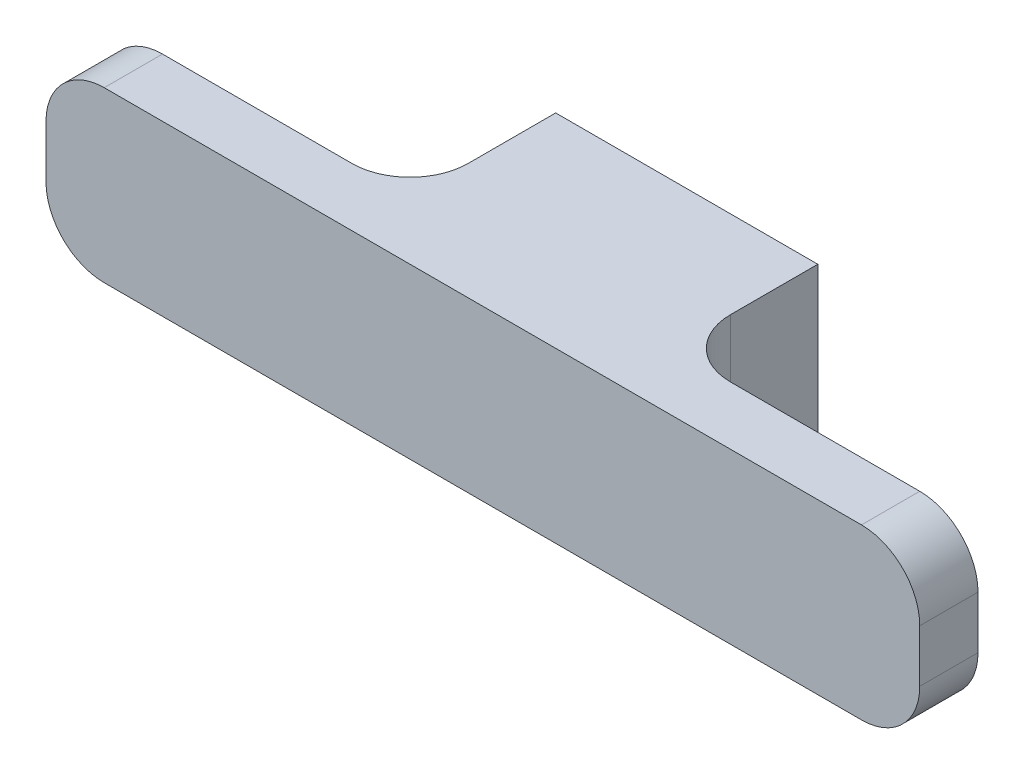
ISO-10303-21;
HEADER;
FILE_DESCRIPTION(('STEP AP214'),'2;1');
FILE_NAME('part.step','',(''),(''),'','','');
FILE_SCHEMA(('AUTOMOTIVE_DESIGN { 1 0 10303 214 1 1 1 1 }'));
ENDSEC;
DATA;
#1=APPLICATION_CONTEXT('core data for automotive mechanical design processes');
#2=APPLICATION_PROTOCOL_DEFINITION('international standard','automotive_design',2000,#1);
#3=PRODUCT_CONTEXT('',#1,'mechanical');
#4=PRODUCT('Part','Part','',(#3));
#5=PRODUCT_RELATED_PRODUCT_CATEGORY('part','',(#4));
#6=PRODUCT_DEFINITION_FORMATION('','',#4);
#7=PRODUCT_DEFINITION_CONTEXT('part definition',#1,'design');
#8=PRODUCT_DEFINITION('design','',#6,#7);
#9=PRODUCT_DEFINITION_SHAPE('','',#8);
#10=(LENGTH_UNIT() NAMED_UNIT(*) SI_UNIT(.MILLI.,.METRE.));
#11=(NAMED_UNIT(*) PLANE_ANGLE_UNIT() SI_UNIT($,.RADIAN.));
#12=(NAMED_UNIT(*) SI_UNIT($,.STERADIAN.) SOLID_ANGLE_UNIT());
#13=UNCERTAINTY_MEASURE_WITH_UNIT(LENGTH_MEASURE(1.E-05),#10,'distance_accuracy_value','');
#14=(GEOMETRIC_REPRESENTATION_CONTEXT(3) GLOBAL_UNCERTAINTY_ASSIGNED_CONTEXT((#13)) GLOBAL_UNIT_ASSIGNED_CONTEXT((#10,
#11,#12)) REPRESENTATION_CONTEXT('',''));
#15=CARTESIAN_POINT('',(0.,0.,0.));
#16=DIRECTION('',(0.,0.,1.));
#17=DIRECTION('',(1.,0.,0.));
#18=AXIS2_PLACEMENT_3D('',#15,#16,#17);
#19=CARTESIAN_POINT('',(2.25,-1.45,2.5));
#20=DIRECTION('',(-1.,0.,0.));
#21=DIRECTION('',(0.,0.,1.));
#22=AXIS2_PLACEMENT_3D('',#19,#20,#21);
#23=PLANE('',#22);
#24=DIRECTION('',(0.,0.,-1.));
#25=VECTOR('',#24,1.);
#26=CARTESIAN_POINT('',(2.25,1.45,2.5));
#27=LINE('',#26,#25);
#28=CARTESIAN_POINT('',(2.25,1.45,1.5));
#29=VERTEX_POINT('',#28);
#30=CARTESIAN_POINT('',(2.25,1.45,0.));
#31=VERTEX_POINT('',#30);
#32=EDGE_CURVE('E136',#29,#31,#27,.T.);
#33=ORIENTED_EDGE('',*,*,#32,.F.);
#34=DIRECTION('',(0.,1.,0.));
#35=VECTOR('',#34,1.);
#36=CARTESIAN_POINT('',(2.25,-1.45,1.5));
#37=LINE('',#36,#35);
#38=CARTESIAN_POINT('',(2.25,-1.45,1.5));
#39=VERTEX_POINT('',#38);
#40=EDGE_CURVE('E180',#29,#39,#37,.F.);
#41=ORIENTED_EDGE('',*,*,#40,.T.);
#42=DIRECTION('',(0.,0.,-1.));
#43=VECTOR('',#42,1.);
#44=CARTESIAN_POINT('',(2.25,-1.45,2.5));
#45=LINE('',#44,#43);
#46=CARTESIAN_POINT('',(2.25,-1.45,0.));
#47=VERTEX_POINT('',#46);
#48=EDGE_CURVE('E160',#39,#47,#45,.T.);
#49=ORIENTED_EDGE('',*,*,#48,.T.);
#50=DIRECTION('',(0.,1.,0.));
#51=VECTOR('',#50,1.);
#52=CARTESIAN_POINT('',(2.25,-1.45,0.));
#53=LINE('',#52,#51);
#54=EDGE_CURVE('E155',#47,#31,#53,.T.);
#55=ORIENTED_EDGE('',*,*,#54,.T.);
#56=EDGE_LOOP('',(#33,#41,#49,#55));
#57=FACE_BOUND('',#56,.T.);
#58=ADVANCED_FACE('F34',(#57),#23,.F.);
#59=CARTESIAN_POINT('',(-2.25,1.45,2.5));
#60=DIRECTION('',(0.,-1.,0.));
#61=DIRECTION('',(0.,0.,-1.));
#62=AXIS2_PLACEMENT_3D('',#59,#60,#61);
#63=PLANE('',#62);
#64=DIRECTION('',(-1.,0.,0.));
#65=VECTOR('',#64,1.);
#66=CARTESIAN_POINT('',(-7.5,1.45,2.5));
#67=LINE('',#66,#65);
#68=CARTESIAN_POINT('',(-3.25,1.45,2.5));
#69=VERTEX_POINT('',#68);
#70=CARTESIAN_POINT('',(-6.5,1.45,2.5));
#71=VERTEX_POINT('',#70);
#72=EDGE_CURVE('E232',#69,#71,#67,.T.);
#73=ORIENTED_EDGE('',*,*,#72,.T.);
#74=DIRECTION('',(0.,0.,-1.));
#75=VECTOR('',#74,1.);
#76=CARTESIAN_POINT('',(-6.5,1.45,2.5));
#77=LINE('',#76,#75);
#78=CARTESIAN_POINT('',(-6.5,1.45,3.5));
#79=VERTEX_POINT('',#78);
#80=EDGE_CURVE('E206',#71,#79,#77,.F.);
#81=ORIENTED_EDGE('',*,*,#80,.T.);
#82=DIRECTION('',(-1.,0.,0.));
#83=VECTOR('',#82,1.);
#84=CARTESIAN_POINT('',(-7.5,1.45,3.5));
#85=LINE('',#84,#83);
#86=CARTESIAN_POINT('',(6.5,1.45,3.5));
#87=VERTEX_POINT('',#86);
#88=EDGE_CURVE('E162',#87,#79,#85,.T.);
#89=ORIENTED_EDGE('',*,*,#88,.F.);
#90=DIRECTION('',(0.,0.,-1.));
#91=VECTOR('',#90,1.);
#92=CARTESIAN_POINT('',(6.5,1.45,2.5));
#93=LINE('',#92,#91);
#94=CARTESIAN_POINT('',(6.5,1.45,2.5));
#95=VERTEX_POINT('',#94);
#96=EDGE_CURVE('E203',#87,#95,#93,.T.);
#97=ORIENTED_EDGE('',*,*,#96,.T.);
#98=CARTESIAN_POINT('',(3.25,1.45,2.5));
#99=VERTEX_POINT('',#98);
#100=EDGE_CURVE('E168',#95,#99,#67,.T.);
#101=ORIENTED_EDGE('',*,*,#100,.T.);
#102=CARTESIAN_POINT('',(3.25,1.45,1.5));
#103=DIRECTION('',(0.,-1.,0.));
#104=DIRECTION('',(0.,0.,-1.));
#105=AXIS2_PLACEMENT_3D('',#102,#103,#104);
#106=CIRCLE('',#105,1.);
#107=EDGE_CURVE('E144',#99,#29,#106,.T.);
#108=ORIENTED_EDGE('',*,*,#107,.T.);
#109=ORIENTED_EDGE('',*,*,#32,.T.);
#110=DIRECTION('',(-1.,0.,0.));
#111=VECTOR('',#110,1.);
#112=CARTESIAN_POINT('',(-2.25,1.45,0.));
#113=LINE('',#112,#111);
#114=CARTESIAN_POINT('',(-2.25,1.45,0.));
#115=VERTEX_POINT('',#114);
#116=EDGE_CURVE('E141',#31,#115,#113,.T.);
#117=ORIENTED_EDGE('',*,*,#116,.T.);
#118=DIRECTION('',(0.,0.,-1.));
#119=VECTOR('',#118,1.);
#120=CARTESIAN_POINT('',(-2.25,1.45,2.5));
#121=LINE('',#120,#119);
#122=CARTESIAN_POINT('',(-2.25,1.45,1.5));
#123=VERTEX_POINT('',#122);
#124=EDGE_CURVE('E149',#123,#115,#121,.T.);
#125=ORIENTED_EDGE('',*,*,#124,.F.);
#126=CARTESIAN_POINT('',(-3.25,1.45,1.5));
#127=DIRECTION('',(0.,-1.,0.));
#128=DIRECTION('',(0.,0.,-1.));
#129=AXIS2_PLACEMENT_3D('',#126,#127,#128);
#130=CIRCLE('',#129,1.);
#131=EDGE_CURVE('E192',#123,#69,#130,.T.);
#132=ORIENTED_EDGE('',*,*,#131,.T.);
#133=EDGE_LOOP('',(#73,#81,#89,#97,#101,#108,#109,#117,#125,#132));
#134=FACE_BOUND('',#133,.T.);
#135=ADVANCED_FACE('F139',(#134),#63,.F.);
#136=CARTESIAN_POINT('',(-2.25,-1.45,2.5));
#137=DIRECTION('',(1.,0.,0.));
#138=DIRECTION('',(0.,0.,-1.));
#139=AXIS2_PLACEMENT_3D('',#136,#137,#138);
#140=PLANE('',#139);
#141=DIRECTION('',(0.,0.,-1.));
#142=VECTOR('',#141,1.);
#143=CARTESIAN_POINT('',(-2.25,-1.45,2.5));
#144=LINE('',#143,#142);
#145=CARTESIAN_POINT('',(-2.25,-1.45,1.5));
#146=VERTEX_POINT('',#145);
#147=CARTESIAN_POINT('',(-2.25,-1.45,0.));
#148=VERTEX_POINT('',#147);
#149=EDGE_CURVE('E175',#146,#148,#144,.T.);
#150=ORIENTED_EDGE('',*,*,#149,.F.);
#151=DIRECTION('',(0.,-1.,0.));
#152=VECTOR('',#151,1.);
#153=CARTESIAN_POINT('',(-2.25,-1.45,1.5));
#154=LINE('',#153,#152);
#155=EDGE_CURVE('E185',#146,#123,#154,.F.);
#156=ORIENTED_EDGE('',*,*,#155,.T.);
#157=ORIENTED_EDGE('',*,*,#124,.T.);
#158=DIRECTION('',(0.,-1.,0.));
#159=VECTOR('',#158,1.);
#160=CARTESIAN_POINT('',(-2.25,-1.45,0.));
#161=LINE('',#160,#159);
#162=EDGE_CURVE('E157',#115,#148,#161,.T.);
#163=ORIENTED_EDGE('',*,*,#162,.T.);
#164=EDGE_LOOP('',(#150,#156,#157,#163));
#165=FACE_BOUND('',#164,.T.);
#166=ADVANCED_FACE('F284',(#165),#140,.F.);
#167=CARTESIAN_POINT('',(-2.25,-1.45,2.5));
#168=DIRECTION('',(0.,1.,0.));
#169=DIRECTION('',(0.,0.,1.));
#170=AXIS2_PLACEMENT_3D('',#167,#168,#169);
#171=PLANE('',#170);
#172=DIRECTION('',(1.,0.,0.));
#173=VECTOR('',#172,1.);
#174=CARTESIAN_POINT('',(-7.5,-1.45,3.5));
#175=LINE('',#174,#173);
#176=CARTESIAN_POINT('',(-6.5,-1.45,3.5));
#177=VERTEX_POINT('',#176);
#178=CARTESIAN_POINT('',(6.5,-1.45,3.5));
#179=VERTEX_POINT('',#178);
#180=EDGE_CURVE('E241',#177,#179,#175,.T.);
#181=ORIENTED_EDGE('',*,*,#180,.F.);
#182=DIRECTION('',(0.,0.,-1.));
#183=VECTOR('',#182,1.);
#184=CARTESIAN_POINT('',(-6.5,-1.45,2.5));
#185=LINE('',#184,#183);
#186=CARTESIAN_POINT('',(-6.5,-1.45,2.5));
#187=VERTEX_POINT('',#186);
#188=EDGE_CURVE('E218',#177,#187,#185,.T.);
#189=ORIENTED_EDGE('',*,*,#188,.T.);
#190=DIRECTION('',(1.,0.,0.));
#191=VECTOR('',#190,1.);
#192=CARTESIAN_POINT('',(-7.5,-1.45,2.5));
#193=LINE('',#192,#191);
#194=CARTESIAN_POINT('',(-3.25,-1.45,2.5));
#195=VERTEX_POINT('',#194);
#196=EDGE_CURVE('E233',#187,#195,#193,.T.);
#197=ORIENTED_EDGE('',*,*,#196,.T.);
#198=CARTESIAN_POINT('',(-3.25,-1.45,1.5));
#199=DIRECTION('',(0.,1.,0.));
#200=DIRECTION('',(0.,0.,1.));
#201=AXIS2_PLACEMENT_3D('',#198,#199,#200);
#202=CIRCLE('',#201,1.);
#203=EDGE_CURVE('E190',#195,#146,#202,.T.);
#204=ORIENTED_EDGE('',*,*,#203,.T.);
#205=ORIENTED_EDGE('',*,*,#149,.T.);
#206=DIRECTION('',(1.,0.,0.));
#207=VECTOR('',#206,1.);
#208=CARTESIAN_POINT('',(-2.25,-1.45,0.));
#209=LINE('',#208,#207);
#210=EDGE_CURVE('E172',#148,#47,#209,.T.);
#211=ORIENTED_EDGE('',*,*,#210,.T.);
#212=ORIENTED_EDGE('',*,*,#48,.F.);
#213=CARTESIAN_POINT('',(3.25,-1.45,1.5));
#214=DIRECTION('',(0.,1.,0.));
#215=DIRECTION('',(0.,0.,1.));
#216=AXIS2_PLACEMENT_3D('',#213,#214,#215);
#217=CIRCLE('',#216,1.);
#218=CARTESIAN_POINT('',(3.25,-1.45,2.5));
#219=VERTEX_POINT('',#218);
#220=EDGE_CURVE('E188',#39,#219,#217,.T.);
#221=ORIENTED_EDGE('',*,*,#220,.T.);
#222=CARTESIAN_POINT('',(6.5,-1.45,2.5));
#223=VERTEX_POINT('',#222);
#224=EDGE_CURVE('E234',#219,#223,#193,.T.);
#225=ORIENTED_EDGE('',*,*,#224,.T.);
#226=DIRECTION('',(0.,0.,-1.));
#227=VECTOR('',#226,1.);
#228=CARTESIAN_POINT('',(6.5,-1.45,2.5));
#229=LINE('',#228,#227);
#230=EDGE_CURVE('E216',#223,#179,#229,.F.);
#231=ORIENTED_EDGE('',*,*,#230,.T.);
#232=EDGE_LOOP('',(#181,#189,#197,#204,#205,#211,#212,#221,#225,#231));
#233=FACE_BOUND('',#232,.T.);
#234=ADVANCED_FACE('F257',(#233),#171,.F.);
#235=CARTESIAN_POINT('',(0.,0.,0.));
#236=DIRECTION('',(0.,0.,-1.));
#237=DIRECTION('',(-1.,0.,0.));
#238=AXIS2_PLACEMENT_3D('',#235,#236,#237);
#239=PLANE('',#238);
#240=ORIENTED_EDGE('',*,*,#54,.F.);
#241=ORIENTED_EDGE('',*,*,#210,.F.);
#242=ORIENTED_EDGE('',*,*,#162,.F.);
#243=ORIENTED_EDGE('',*,*,#116,.F.);
#244=EDGE_LOOP('',(#240,#241,#242,#243));
#245=FACE_BOUND('',#244,.T.);
#246=ADVANCED_FACE('F153',(#245),#239,.T.);
#247=CARTESIAN_POINT('',(0.,0.,2.5));
#248=DIRECTION('',(0.,0.,-1.));
#249=DIRECTION('',(-1.,0.,0.));
#250=AXIS2_PLACEMENT_3D('',#247,#248,#249);
#251=PLANE('',#250);
#252=ORIENTED_EDGE('',*,*,#100,.F.);
#253=CARTESIAN_POINT('',(6.5,0.45,2.5));
#254=DIRECTION('',(0.,0.,-1.));
#255=DIRECTION('',(-1.,0.,0.));
#256=AXIS2_PLACEMENT_3D('',#253,#254,#255);
#257=CIRCLE('',#256,1.);
#258=CARTESIAN_POINT('',(7.5,0.45,2.5));
#259=VERTEX_POINT('',#258);
#260=EDGE_CURVE('E49',#95,#259,#257,.T.);
#261=ORIENTED_EDGE('',*,*,#260,.T.);
#262=DIRECTION('',(0.,1.,0.));
#263=VECTOR('',#262,1.);
#264=CARTESIAN_POINT('',(7.5,-1.45,2.5));
#265=LINE('',#264,#263);
#266=CARTESIAN_POINT('',(7.5,-0.449999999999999,2.5));
#267=VERTEX_POINT('',#266);
#268=EDGE_CURVE('E225',#267,#259,#265,.T.);
#269=ORIENTED_EDGE('',*,*,#268,.F.);
#270=CARTESIAN_POINT('',(6.5,-0.449999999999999,2.5));
#271=DIRECTION('',(0.,0.,-1.));
#272=DIRECTION('',(-1.,0.,0.));
#273=AXIS2_PLACEMENT_3D('',#270,#271,#272);
#274=CIRCLE('',#273,1.);
#275=EDGE_CURVE('E57',#267,#223,#274,.T.);
#276=ORIENTED_EDGE('',*,*,#275,.T.);
#277=ORIENTED_EDGE('',*,*,#224,.F.);
#278=DIRECTION('',(0.,1.,0.));
#279=VECTOR('',#278,1.);
#280=CARTESIAN_POINT('',(3.25,0.,2.5));
#281=LINE('',#280,#279);
#282=EDGE_CURVE('E148',#219,#99,#281,.T.);
#283=ORIENTED_EDGE('',*,*,#282,.T.);
#284=EDGE_LOOP('',(#252,#261,#269,#276,#277,#283));
#285=FACE_BOUND('',#284,.T.);
#286=ADVANCED_FACE('F229',(#285),#251,.T.);
#287=CARTESIAN_POINT('',(-7.5,-1.45,3.5));
#288=DIRECTION('',(1.,0.,0.));
#289=DIRECTION('',(0.,0.,-1.));
#290=AXIS2_PLACEMENT_3D('',#287,#288,#289);
#291=PLANE('',#290);
#292=DIRECTION('',(0.,-1.,0.));
#293=VECTOR('',#292,1.);
#294=CARTESIAN_POINT('',(-7.5,-1.45,3.5));
#295=LINE('',#294,#293);
#296=CARTESIAN_POINT('',(-7.5,0.45,3.5));
#297=VERTEX_POINT('',#296);
#298=CARTESIAN_POINT('',(-7.5,-0.449999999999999,3.5));
#299=VERTEX_POINT('',#298);
#300=EDGE_CURVE('E244',#297,#299,#295,.T.);
#301=ORIENTED_EDGE('',*,*,#300,.F.);
#302=DIRECTION('',(0.,0.,-1.));
#303=VECTOR('',#302,1.);
#304=CARTESIAN_POINT('',(-7.5,0.45,3.5));
#305=LINE('',#304,#303);
#306=CARTESIAN_POINT('',(-7.5,0.45,2.5));
#307=VERTEX_POINT('',#306);
#308=EDGE_CURVE('E196',#297,#307,#305,.T.);
#309=ORIENTED_EDGE('',*,*,#308,.T.);
#310=DIRECTION('',(0.,-1.,0.));
#311=VECTOR('',#310,1.);
#312=CARTESIAN_POINT('',(-7.5,-1.45,2.5));
#313=LINE('',#312,#311);
#314=CARTESIAN_POINT('',(-7.5,-0.449999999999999,2.5));
#315=VERTEX_POINT('',#314);
#316=EDGE_CURVE('E237',#307,#315,#313,.T.);
#317=ORIENTED_EDGE('',*,*,#316,.T.);
#318=DIRECTION('',(0.,0.,-1.));
#319=VECTOR('',#318,1.);
#320=CARTESIAN_POINT('',(-7.5,-0.449999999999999,3.5));
#321=LINE('',#320,#319);
#322=EDGE_CURVE('E194',#315,#299,#321,.F.);
#323=ORIENTED_EDGE('',*,*,#322,.T.);
#324=EDGE_LOOP('',(#301,#309,#317,#323));
#325=FACE_BOUND('',#324,.T.);
#326=ADVANCED_FACE('F269',(#325),#291,.F.);
#327=CARTESIAN_POINT('',(7.5,-1.45,3.5));
#328=DIRECTION('',(-1.,0.,0.));
#329=DIRECTION('',(0.,0.,1.));
#330=AXIS2_PLACEMENT_3D('',#327,#328,#329);
#331=PLANE('',#330);
#332=ORIENTED_EDGE('',*,*,#268,.T.);
#333=DIRECTION('',(0.,0.,-1.));
#334=VECTOR('',#333,1.);
#335=CARTESIAN_POINT('',(7.5,0.45,3.5));
#336=LINE('',#335,#334);
#337=CARTESIAN_POINT('',(7.5,0.45,3.5));
#338=VERTEX_POINT('',#337);
#339=EDGE_CURVE('E11',#259,#338,#336,.F.);
#340=ORIENTED_EDGE('',*,*,#339,.T.);
#341=DIRECTION('',(0.,1.,0.));
#342=VECTOR('',#341,1.);
#343=CARTESIAN_POINT('',(7.5,-1.45,3.5));
#344=LINE('',#343,#342);
#345=CARTESIAN_POINT('',(7.5,-0.449999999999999,3.5));
#346=VERTEX_POINT('',#345);
#347=EDGE_CURVE('E165',#346,#338,#344,.T.);
#348=ORIENTED_EDGE('',*,*,#347,.F.);
#349=DIRECTION('',(0.,0.,-1.));
#350=VECTOR('',#349,1.);
#351=CARTESIAN_POINT('',(7.5,-0.449999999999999,3.5));
#352=LINE('',#351,#350);
#353=EDGE_CURVE('E42',#346,#267,#352,.T.);
#354=ORIENTED_EDGE('',*,*,#353,.T.);
#355=EDGE_LOOP('',(#332,#340,#348,#354));
#356=FACE_BOUND('',#355,.T.);
#357=ADVANCED_FACE('F224',(#356),#331,.F.);
#358=CARTESIAN_POINT('',(0.,0.,3.5));
#359=DIRECTION('',(0.,0.,-1.));
#360=DIRECTION('',(-1.,0.,0.));
#361=AXIS2_PLACEMENT_3D('',#358,#359,#360);
#362=PLANE('',#361);
#363=ORIENTED_EDGE('',*,*,#88,.T.);
#364=CARTESIAN_POINT('',(-6.5,0.45,3.5));
#365=DIRECTION('',(0.,0.,-1.));
#366=DIRECTION('',(-1.,0.,0.));
#367=AXIS2_PLACEMENT_3D('',#364,#365,#366);
#368=CIRCLE('',#367,1.);
#369=EDGE_CURVE('E214',#79,#297,#368,.F.);
#370=ORIENTED_EDGE('',*,*,#369,.T.);
#371=ORIENTED_EDGE('',*,*,#300,.T.);
#372=CARTESIAN_POINT('',(-6.5,-0.449999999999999,3.5));
#373=DIRECTION('',(0.,0.,-1.));
#374=DIRECTION('',(-1.,0.,0.));
#375=AXIS2_PLACEMENT_3D('',#372,#373,#374);
#376=CIRCLE('',#375,1.);
#377=EDGE_CURVE('E212',#299,#177,#376,.F.);
#378=ORIENTED_EDGE('',*,*,#377,.T.);
#379=ORIENTED_EDGE('',*,*,#180,.T.);
#380=CARTESIAN_POINT('',(6.5,-0.449999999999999,3.5));
#381=DIRECTION('',(0.,0.,-1.));
#382=DIRECTION('',(-1.,0.,0.));
#383=AXIS2_PLACEMENT_3D('',#380,#381,#382);
#384=CIRCLE('',#383,1.);
#385=EDGE_CURVE('E208',#179,#346,#384,.F.);
#386=ORIENTED_EDGE('',*,*,#385,.T.);
#387=ORIENTED_EDGE('',*,*,#347,.T.);
#388=CARTESIAN_POINT('',(6.5,0.45,3.5));
#389=DIRECTION('',(0.,0.,-1.));
#390=DIRECTION('',(-1.,0.,0.));
#391=AXIS2_PLACEMENT_3D('',#388,#389,#390);
#392=CIRCLE('',#391,1.);
#393=EDGE_CURVE('E210',#338,#87,#392,.F.);
#394=ORIENTED_EDGE('',*,*,#393,.T.);
#395=EDGE_LOOP('',(#363,#370,#371,#378,#379,#386,#387,#394));
#396=FACE_BOUND('',#395,.T.);
#397=ADVANCED_FACE('F258',(#396),#362,.F.);
#398=ORIENTED_EDGE('',*,*,#316,.F.);
#399=CARTESIAN_POINT('',(-6.5,0.45,2.5));
#400=DIRECTION('',(0.,0.,-1.));
#401=DIRECTION('',(-1.,0.,0.));
#402=AXIS2_PLACEMENT_3D('',#399,#400,#401);
#403=CIRCLE('',#402,1.);
#404=EDGE_CURVE('E201',#307,#71,#403,.T.);
#405=ORIENTED_EDGE('',*,*,#404,.T.);
#406=ORIENTED_EDGE('',*,*,#72,.F.);
#407=DIRECTION('',(0.,-1.,0.));
#408=VECTOR('',#407,1.);
#409=CARTESIAN_POINT('',(-3.25,0.,2.5));
#410=LINE('',#409,#408);
#411=EDGE_CURVE('E182',#69,#195,#410,.T.);
#412=ORIENTED_EDGE('',*,*,#411,.T.);
#413=ORIENTED_EDGE('',*,*,#196,.F.);
#414=CARTESIAN_POINT('',(-6.5,-0.449999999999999,2.5));
#415=DIRECTION('',(0.,0.,-1.));
#416=DIRECTION('',(-1.,0.,0.));
#417=AXIS2_PLACEMENT_3D('',#414,#415,#416);
#418=CIRCLE('',#417,1.);
#419=EDGE_CURVE('E199',#187,#315,#418,.T.);
#420=ORIENTED_EDGE('',*,*,#419,.T.);
#421=EDGE_LOOP('',(#398,#405,#406,#412,#413,#420));
#422=FACE_BOUND('',#421,.T.);
#423=ADVANCED_FACE('F267',(#422),#251,.T.);
#424=CARTESIAN_POINT('',(3.25,0.,1.5));
#425=DIRECTION('',(0.,1.,0.));
#426=DIRECTION('',(0.,0.,1.));
#427=AXIS2_PLACEMENT_3D('',#424,#425,#426);
#428=CYLINDRICAL_SURFACE('',#427,1.);
#429=ORIENTED_EDGE('',*,*,#220,.F.);
#430=ORIENTED_EDGE('',*,*,#40,.F.);
#431=ORIENTED_EDGE('',*,*,#107,.F.);
#432=ORIENTED_EDGE('',*,*,#282,.F.);
#433=EDGE_LOOP('',(#429,#430,#431,#432));
#434=FACE_BOUND('',#433,.T.);
#435=ADVANCED_FACE('F254',(#434),#428,.F.);
#436=CARTESIAN_POINT('',(-3.25,0.,1.5));
#437=DIRECTION('',(0.,-1.,0.));
#438=DIRECTION('',(0.,0.,-1.));
#439=AXIS2_PLACEMENT_3D('',#436,#437,#438);
#440=CYLINDRICAL_SURFACE('',#439,1.);
#441=ORIENTED_EDGE('',*,*,#131,.F.);
#442=ORIENTED_EDGE('',*,*,#155,.F.);
#443=ORIENTED_EDGE('',*,*,#203,.F.);
#444=ORIENTED_EDGE('',*,*,#411,.F.);
#445=EDGE_LOOP('',(#441,#442,#443,#444));
#446=FACE_BOUND('',#445,.T.);
#447=ADVANCED_FACE('F280',(#446),#440,.F.);
#448=CARTESIAN_POINT('',(-6.5,0.45,3.5));
#449=DIRECTION('',(0.,0.,-1.));
#450=DIRECTION('',(-1.,0.,0.));
#451=AXIS2_PLACEMENT_3D('',#448,#449,#450);
#452=CYLINDRICAL_SURFACE('',#451,1.);
#453=ORIENTED_EDGE('',*,*,#369,.F.);
#454=ORIENTED_EDGE('',*,*,#80,.F.);
#455=ORIENTED_EDGE('',*,*,#404,.F.);
#456=ORIENTED_EDGE('',*,*,#308,.F.);
#457=EDGE_LOOP('',(#453,#454,#455,#456));
#458=FACE_BOUND('',#457,.T.);
#459=ADVANCED_FACE('F273',(#458),#452,.T.);
#460=CARTESIAN_POINT('',(-6.5,-0.449999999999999,2.5));
#461=DIRECTION('',(0.,0.,-1.));
#462=DIRECTION('',(-1.,0.,0.));
#463=AXIS2_PLACEMENT_3D('',#460,#461,#462);
#464=CYLINDRICAL_SURFACE('',#463,1.);
#465=ORIENTED_EDGE('',*,*,#377,.F.);
#466=ORIENTED_EDGE('',*,*,#322,.F.);
#467=ORIENTED_EDGE('',*,*,#419,.F.);
#468=ORIENTED_EDGE('',*,*,#188,.F.);
#469=EDGE_LOOP('',(#465,#466,#467,#468));
#470=FACE_BOUND('',#469,.T.);
#471=ADVANCED_FACE('F263',(#470),#464,.T.);
#472=CARTESIAN_POINT('',(6.5,0.45,2.5));
#473=DIRECTION('',(0.,0.,-1.));
#474=DIRECTION('',(-1.,0.,0.));
#475=AXIS2_PLACEMENT_3D('',#472,#473,#474);
#476=CYLINDRICAL_SURFACE('',#475,1.);
#477=ORIENTED_EDGE('',*,*,#393,.F.);
#478=ORIENTED_EDGE('',*,*,#339,.F.);
#479=ORIENTED_EDGE('',*,*,#260,.F.);
#480=ORIENTED_EDGE('',*,*,#96,.F.);
#481=EDGE_LOOP('',(#477,#478,#479,#480));
#482=FACE_BOUND('',#481,.T.);
#483=ADVANCED_FACE('F305',(#482),#476,.T.);
#484=CARTESIAN_POINT('',(6.5,-0.449999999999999,3.5));
#485=DIRECTION('',(0.,0.,-1.));
#486=DIRECTION('',(-1.,0.,0.));
#487=AXIS2_PLACEMENT_3D('',#484,#485,#486);
#488=CYLINDRICAL_SURFACE('',#487,1.);
#489=ORIENTED_EDGE('',*,*,#385,.F.);
#490=ORIENTED_EDGE('',*,*,#230,.F.);
#491=ORIENTED_EDGE('',*,*,#275,.F.);
#492=ORIENTED_EDGE('',*,*,#353,.F.);
#493=EDGE_LOOP('',(#489,#490,#491,#492));
#494=FACE_BOUND('',#493,.T.);
#495=ADVANCED_FACE('F36',(#494),#488,.T.);
#496=CLOSED_SHELL('',(#58,#135,#166,#234,#246,#286,#326,#357,#397,#423,#435,#447,#459,#471,#483,#495));
#497=MANIFOLD_SOLID_BREP('B2',#496);
#498=ADVANCED_BREP_SHAPE_REPRESENTATION('',(#18,#497),#14);
#499=SHAPE_DEFINITION_REPRESENTATION(#9,#498);
ENDSEC;
END-ISO-10303-21;
